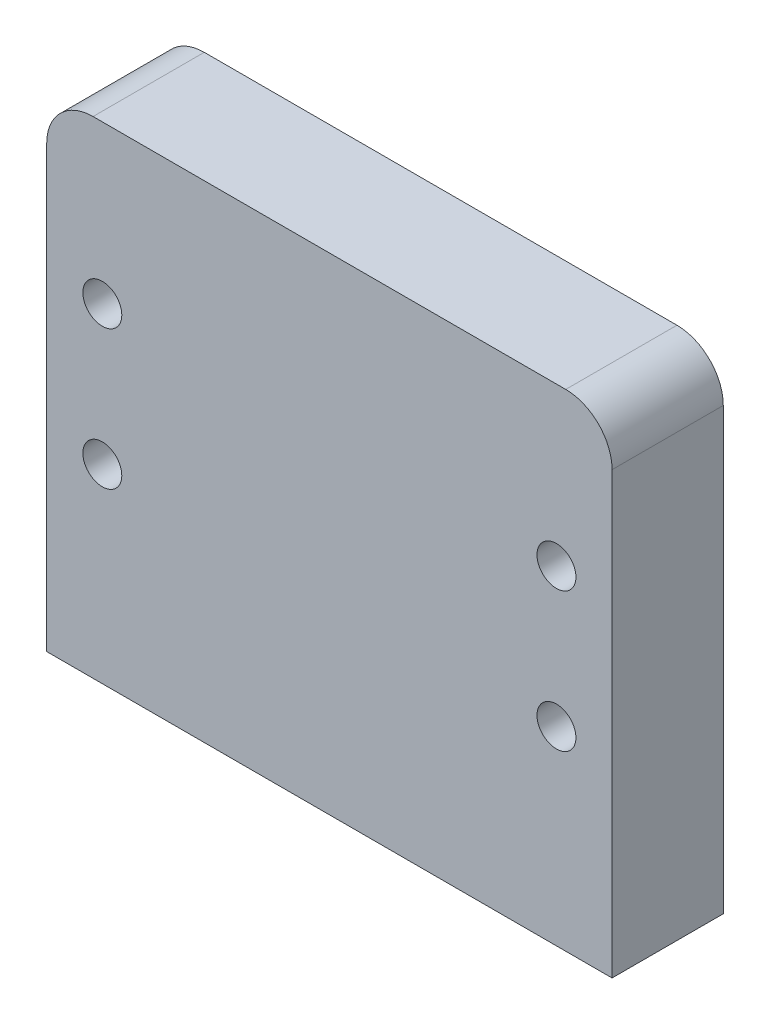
ISO-10303-21;
HEADER;
FILE_DESCRIPTION(('STEP AP214'),'2;1');
FILE_NAME('part.step','',(''),(''),'','','');
FILE_SCHEMA(('AUTOMOTIVE_DESIGN { 1 0 10303 214 1 1 1 1 }'));
ENDSEC;
DATA;
#1=APPLICATION_CONTEXT('core data for automotive mechanical design processes');
#2=APPLICATION_PROTOCOL_DEFINITION('international standard','automotive_design',2000,#1);
#3=PRODUCT_CONTEXT('',#1,'mechanical');
#4=PRODUCT('Part','Part','',(#3));
#5=PRODUCT_RELATED_PRODUCT_CATEGORY('part','',(#4));
#6=PRODUCT_DEFINITION_FORMATION('','',#4);
#7=PRODUCT_DEFINITION_CONTEXT('part definition',#1,'design');
#8=PRODUCT_DEFINITION('design','',#6,#7);
#9=PRODUCT_DEFINITION_SHAPE('','',#8);
#10=(LENGTH_UNIT() NAMED_UNIT(*) SI_UNIT(.MILLI.,.METRE.));
#11=(NAMED_UNIT(*) PLANE_ANGLE_UNIT() SI_UNIT($,.RADIAN.));
#12=(NAMED_UNIT(*) SI_UNIT($,.STERADIAN.) SOLID_ANGLE_UNIT());
#13=UNCERTAINTY_MEASURE_WITH_UNIT(LENGTH_MEASURE(1.E-05),#10,'distance_accuracy_value','');
#14=(GEOMETRIC_REPRESENTATION_CONTEXT(3) GLOBAL_UNCERTAINTY_ASSIGNED_CONTEXT((#13)) GLOBAL_UNIT_ASSIGNED_CONTEXT((#10,
#11,#12)) REPRESENTATION_CONTEXT('',''));
#15=CARTESIAN_POINT('',(0.,0.,0.));
#16=DIRECTION('',(0.,0.,1.));
#17=DIRECTION('',(1.,0.,0.));
#18=AXIS2_PLACEMENT_3D('',#15,#16,#17);
#19=CARTESIAN_POINT('',(-30.5,0.,12.));
#20=DIRECTION('',(1.,0.,0.));
#21=DIRECTION('',(0.,0.,-1.));
#22=AXIS2_PLACEMENT_3D('',#19,#20,#21);
#23=PLANE('',#22);
#24=DIRECTION('',(0.,-1.,0.));
#25=VECTOR('',#24,1.);
#26=CARTESIAN_POINT('',(-30.5,0.,12.));
#27=LINE('',#26,#25);
#28=CARTESIAN_POINT('',(-30.5,47.5,12.));
#29=VERTEX_POINT('',#28);
#30=CARTESIAN_POINT('',(-30.5,0.,12.));
#31=VERTEX_POINT('',#30);
#32=EDGE_CURVE('E90',#29,#31,#27,.T.);
#33=ORIENTED_EDGE('',*,*,#32,.F.);
#34=DIRECTION('',(0.,0.,-1.));
#35=VECTOR('',#34,1.);
#36=CARTESIAN_POINT('',(-30.5,47.5,12.));
#37=LINE('',#36,#35);
#38=CARTESIAN_POINT('',(-30.5,47.5,0.));
#39=VERTEX_POINT('',#38);
#40=EDGE_CURVE('E11',#29,#39,#37,.T.);
#41=ORIENTED_EDGE('',*,*,#40,.T.);
#42=DIRECTION('',(0.,-1.,0.));
#43=VECTOR('',#42,1.);
#44=CARTESIAN_POINT('',(-30.5,0.,0.));
#45=LINE('',#44,#43);
#46=CARTESIAN_POINT('',(-30.5,0.,0.));
#47=VERTEX_POINT('',#46);
#48=EDGE_CURVE('E109',#39,#47,#45,.T.);
#49=ORIENTED_EDGE('',*,*,#48,.T.);
#50=DIRECTION('',(0.,0.,-1.));
#51=VECTOR('',#50,1.);
#52=CARTESIAN_POINT('',(-30.5,0.,12.));
#53=LINE('',#52,#51);
#54=EDGE_CURVE('E103',#31,#47,#53,.T.);
#55=ORIENTED_EDGE('',*,*,#54,.F.);
#56=EDGE_LOOP('',(#33,#41,#49,#55));
#57=FACE_BOUND('',#56,.T.);
#58=ADVANCED_FACE('F35',(#57),#23,.F.);
#59=CARTESIAN_POINT('',(-30.5,0.,12.));
#60=DIRECTION('',(0.,1.,0.));
#61=DIRECTION('',(0.,0.,1.));
#62=AXIS2_PLACEMENT_3D('',#59,#60,#61);
#63=PLANE('',#62);
#64=DIRECTION('',(1.,0.,0.));
#65=VECTOR('',#64,1.);
#66=CARTESIAN_POINT('',(-30.5,0.,0.));
#67=LINE('',#66,#65);
#68=CARTESIAN_POINT('',(30.5,0.,0.));
#69=VERTEX_POINT('',#68);
#70=EDGE_CURVE('E155',#47,#69,#67,.T.);
#71=ORIENTED_EDGE('',*,*,#70,.T.);
#72=DIRECTION('',(0.,0.,-1.));
#73=VECTOR('',#72,1.);
#74=CARTESIAN_POINT('',(30.5,0.,12.));
#75=LINE('',#74,#73);
#76=CARTESIAN_POINT('',(30.5,0.,12.));
#77=VERTEX_POINT('',#76);
#78=EDGE_CURVE('E105',#77,#69,#75,.T.);
#79=ORIENTED_EDGE('',*,*,#78,.F.);
#80=DIRECTION('',(1.,0.,0.));
#81=VECTOR('',#80,1.);
#82=CARTESIAN_POINT('',(-30.5,0.,12.));
#83=LINE('',#82,#81);
#84=EDGE_CURVE('E93',#31,#77,#83,.T.);
#85=ORIENTED_EDGE('',*,*,#84,.F.);
#86=ORIENTED_EDGE('',*,*,#54,.T.);
#87=EDGE_LOOP('',(#71,#79,#85,#86));
#88=FACE_BOUND('',#87,.T.);
#89=ADVANCED_FACE('F102',(#88),#63,.F.);
#90=CARTESIAN_POINT('',(30.5,0.,12.));
#91=DIRECTION('',(-1.,0.,0.));
#92=DIRECTION('',(0.,0.,1.));
#93=AXIS2_PLACEMENT_3D('',#90,#91,#92);
#94=PLANE('',#93);
#95=DIRECTION('',(0.,1.,0.));
#96=VECTOR('',#95,1.);
#97=CARTESIAN_POINT('',(30.5,0.,0.));
#98=LINE('',#97,#96);
#99=CARTESIAN_POINT('',(30.5,47.5,0.));
#100=VERTEX_POINT('',#99);
#101=EDGE_CURVE('E157',#69,#100,#98,.T.);
#102=ORIENTED_EDGE('',*,*,#101,.T.);
#103=DIRECTION('',(0.,0.,-1.));
#104=VECTOR('',#103,1.);
#105=CARTESIAN_POINT('',(30.5,47.5,12.));
#106=LINE('',#105,#104);
#107=CARTESIAN_POINT('',(30.5,47.5,12.));
#108=VERTEX_POINT('',#107);
#109=EDGE_CURVE('E60',#100,#108,#106,.F.);
#110=ORIENTED_EDGE('',*,*,#109,.T.);
#111=DIRECTION('',(0.,1.,0.));
#112=VECTOR('',#111,1.);
#113=CARTESIAN_POINT('',(30.5,0.,12.));
#114=LINE('',#113,#112);
#115=EDGE_CURVE('E106',#77,#108,#114,.T.);
#116=ORIENTED_EDGE('',*,*,#115,.F.);
#117=ORIENTED_EDGE('',*,*,#78,.T.);
#118=EDGE_LOOP('',(#102,#110,#116,#117));
#119=FACE_BOUND('',#118,.T.);
#120=ADVANCED_FACE('F169',(#119),#94,.F.);
#121=CARTESIAN_POINT('',(-30.5,52.5,12.));
#122=DIRECTION('',(0.,-1.,0.));
#123=DIRECTION('',(0.,0.,-1.));
#124=AXIS2_PLACEMENT_3D('',#121,#122,#123);
#125=PLANE('',#124);
#126=DIRECTION('',(-1.,0.,0.));
#127=VECTOR('',#126,1.);
#128=CARTESIAN_POINT('',(-30.5,52.5,12.));
#129=LINE('',#128,#127);
#130=CARTESIAN_POINT('',(25.5,52.5,12.));
#131=VERTEX_POINT('',#130);
#132=CARTESIAN_POINT('',(-25.5,52.5,12.));
#133=VERTEX_POINT('',#132);
#134=EDGE_CURVE('E115',#131,#133,#129,.T.);
#135=ORIENTED_EDGE('',*,*,#134,.F.);
#136=DIRECTION('',(0.,0.,-1.));
#137=VECTOR('',#136,1.);
#138=CARTESIAN_POINT('',(25.5,52.5,12.));
#139=LINE('',#138,#137);
#140=CARTESIAN_POINT('',(25.5,52.5,0.));
#141=VERTEX_POINT('',#140);
#142=EDGE_CURVE('E113',#131,#141,#139,.T.);
#143=ORIENTED_EDGE('',*,*,#142,.T.);
#144=DIRECTION('',(-1.,0.,0.));
#145=VECTOR('',#144,1.);
#146=CARTESIAN_POINT('',(-30.5,52.5,0.));
#147=LINE('',#146,#145);
#148=CARTESIAN_POINT('',(-25.5,52.5,0.));
#149=VERTEX_POINT('',#148);
#150=EDGE_CURVE('E98',#141,#149,#147,.T.);
#151=ORIENTED_EDGE('',*,*,#150,.T.);
#152=DIRECTION('',(0.,0.,-1.));
#153=VECTOR('',#152,1.);
#154=CARTESIAN_POINT('',(-25.5,52.5,12.));
#155=LINE('',#154,#153);
#156=EDGE_CURVE('E111',#149,#133,#155,.F.);
#157=ORIENTED_EDGE('',*,*,#156,.T.);
#158=EDGE_LOOP('',(#135,#143,#151,#157));
#159=FACE_BOUND('',#158,.T.);
#160=ADVANCED_FACE('F163',(#159),#125,.F.);
#161=CARTESIAN_POINT('',(-30.5,52.5,12.));
#162=DIRECTION('',(0.,0.,-1.));
#163=DIRECTION('',(-1.,0.,0.));
#164=AXIS2_PLACEMENT_3D('',#161,#162,#163);
#165=PLANE('',#164);
#166=CARTESIAN_POINT('',(-24.5,35.5,12.));
#167=DIRECTION('',(0.,0.,1.));
#168=DIRECTION('',(1.,0.,0.));
#169=AXIS2_PLACEMENT_3D('',#166,#167,#168);
#170=CIRCLE('',#169,2.1);
#171=CARTESIAN_POINT('',(-22.4,35.5,12.));
#172=VERTEX_POINT('',#171);
#173=EDGE_CURVE('E147',#172,#172,#170,.T.);
#174=ORIENTED_EDGE('',*,*,#173,.F.);
#175=EDGE_LOOP('',(#174));
#176=FACE_BOUND('',#175,.T.);
#177=CARTESIAN_POINT('',(-24.5,20.5,12.));
#178=DIRECTION('',(0.,0.,1.));
#179=DIRECTION('',(1.,0.,0.));
#180=AXIS2_PLACEMENT_3D('',#177,#178,#179);
#181=CIRCLE('',#180,2.1);
#182=CARTESIAN_POINT('',(-22.4,20.5,12.));
#183=VERTEX_POINT('',#182);
#184=EDGE_CURVE('E137',#183,#183,#181,.T.);
#185=ORIENTED_EDGE('',*,*,#184,.F.);
#186=EDGE_LOOP('',(#185));
#187=FACE_BOUND('',#186,.T.);
#188=CARTESIAN_POINT('',(24.5,20.5,12.));
#189=DIRECTION('',(0.,0.,1.));
#190=DIRECTION('',(1.,0.,0.));
#191=AXIS2_PLACEMENT_3D('',#188,#189,#190);
#192=CIRCLE('',#191,2.1);
#193=CARTESIAN_POINT('',(26.6,20.5,12.));
#194=VERTEX_POINT('',#193);
#195=EDGE_CURVE('E134',#194,#194,#192,.T.);
#196=ORIENTED_EDGE('',*,*,#195,.F.);
#197=EDGE_LOOP('',(#196));
#198=FACE_BOUND('',#197,.T.);
#199=CARTESIAN_POINT('',(24.5,35.5,12.));
#200=DIRECTION('',(0.,0.,1.));
#201=DIRECTION('',(1.,0.,0.));
#202=AXIS2_PLACEMENT_3D('',#199,#200,#201);
#203=CIRCLE('',#202,2.1);
#204=CARTESIAN_POINT('',(26.6,35.5,12.));
#205=VERTEX_POINT('',#204);
#206=EDGE_CURVE('E131',#205,#205,#203,.T.);
#207=ORIENTED_EDGE('',*,*,#206,.F.);
#208=EDGE_LOOP('',(#207));
#209=FACE_BOUND('',#208,.T.);
#210=ORIENTED_EDGE('',*,*,#115,.T.);
#211=CARTESIAN_POINT('',(25.5,47.5,12.));
#212=DIRECTION('',(0.,0.,-1.));
#213=DIRECTION('',(-1.,0.,0.));
#214=AXIS2_PLACEMENT_3D('',#211,#212,#213);
#215=CIRCLE('',#214,5.);
#216=EDGE_CURVE('E44',#108,#131,#215,.F.);
#217=ORIENTED_EDGE('',*,*,#216,.T.);
#218=ORIENTED_EDGE('',*,*,#134,.T.);
#219=CARTESIAN_POINT('',(-25.5,47.5,12.));
#220=DIRECTION('',(0.,0.,-1.));
#221=DIRECTION('',(-1.,0.,0.));
#222=AXIS2_PLACEMENT_3D('',#219,#220,#221);
#223=CIRCLE('',#222,5.);
#224=EDGE_CURVE('E52',#133,#29,#223,.F.);
#225=ORIENTED_EDGE('',*,*,#224,.T.);
#226=ORIENTED_EDGE('',*,*,#32,.T.);
#227=ORIENTED_EDGE('',*,*,#84,.T.);
#228=EDGE_LOOP('',(#210,#217,#218,#225,#226,#227));
#229=FACE_BOUND('',#228,.T.);
#230=ADVANCED_FACE('F92',(#176,#187,#198,#209,#229),#165,.F.);
#231=CARTESIAN_POINT('',(-30.5,52.5,0.));
#232=DIRECTION('',(0.,0.,-1.));
#233=DIRECTION('',(-1.,0.,0.));
#234=AXIS2_PLACEMENT_3D('',#231,#232,#233);
#235=PLANE('',#234);
#236=CARTESIAN_POINT('',(-24.5,35.5,0.));
#237=DIRECTION('',(0.,0.,-1.));
#238=DIRECTION('',(-1.,0.,0.));
#239=AXIS2_PLACEMENT_3D('',#236,#237,#238);
#240=CIRCLE('',#239,2.1);
#241=CARTESIAN_POINT('',(-26.6,35.5,0.));
#242=VERTEX_POINT('',#241);
#243=EDGE_CURVE('E39',#242,#242,#240,.T.);
#244=ORIENTED_EDGE('',*,*,#243,.F.);
#245=EDGE_LOOP('',(#244));
#246=FACE_BOUND('',#245,.T.);
#247=CARTESIAN_POINT('',(-24.5,20.5,0.));
#248=DIRECTION('',(0.,0.,-1.));
#249=DIRECTION('',(-1.,0.,0.));
#250=AXIS2_PLACEMENT_3D('',#247,#248,#249);
#251=CIRCLE('',#250,2.1);
#252=CARTESIAN_POINT('',(-26.6,20.5,0.));
#253=VERTEX_POINT('',#252);
#254=EDGE_CURVE('E135',#253,#253,#251,.T.);
#255=ORIENTED_EDGE('',*,*,#254,.F.);
#256=EDGE_LOOP('',(#255));
#257=FACE_BOUND('',#256,.T.);
#258=CARTESIAN_POINT('',(24.5,20.5,0.));
#259=DIRECTION('',(0.,0.,-1.));
#260=DIRECTION('',(-1.,0.,0.));
#261=AXIS2_PLACEMENT_3D('',#258,#259,#260);
#262=CIRCLE('',#261,2.1);
#263=CARTESIAN_POINT('',(22.4,20.5,0.));
#264=VERTEX_POINT('',#263);
#265=EDGE_CURVE('E132',#264,#264,#262,.T.);
#266=ORIENTED_EDGE('',*,*,#265,.F.);
#267=EDGE_LOOP('',(#266));
#268=FACE_BOUND('',#267,.T.);
#269=CARTESIAN_POINT('',(24.5,35.5,0.));
#270=DIRECTION('',(0.,0.,-1.));
#271=DIRECTION('',(-1.,0.,0.));
#272=AXIS2_PLACEMENT_3D('',#269,#270,#271);
#273=CIRCLE('',#272,2.1);
#274=CARTESIAN_POINT('',(22.4,35.5,0.));
#275=VERTEX_POINT('',#274);
#276=EDGE_CURVE('E128',#275,#275,#273,.T.);
#277=ORIENTED_EDGE('',*,*,#276,.F.);
#278=EDGE_LOOP('',(#277));
#279=FACE_BOUND('',#278,.T.);
#280=ORIENTED_EDGE('',*,*,#150,.F.);
#281=CARTESIAN_POINT('',(25.5,47.5,0.));
#282=DIRECTION('',(0.,0.,-1.));
#283=DIRECTION('',(-1.,0.,0.));
#284=AXIS2_PLACEMENT_3D('',#281,#282,#283);
#285=CIRCLE('',#284,5.);
#286=EDGE_CURVE('E123',#141,#100,#285,.T.);
#287=ORIENTED_EDGE('',*,*,#286,.T.);
#288=ORIENTED_EDGE('',*,*,#101,.F.);
#289=ORIENTED_EDGE('',*,*,#70,.F.);
#290=ORIENTED_EDGE('',*,*,#48,.F.);
#291=CARTESIAN_POINT('',(-25.5,47.5,0.));
#292=DIRECTION('',(0.,0.,-1.));
#293=DIRECTION('',(-1.,0.,0.));
#294=AXIS2_PLACEMENT_3D('',#291,#292,#293);
#295=CIRCLE('',#294,5.);
#296=EDGE_CURVE('E121',#39,#149,#295,.T.);
#297=ORIENTED_EDGE('',*,*,#296,.T.);
#298=EDGE_LOOP('',(#280,#287,#288,#289,#290,#297));
#299=FACE_BOUND('',#298,.T.);
#300=ADVANCED_FACE('F167',(#246,#257,#268,#279,#299),#235,.T.);
#301=CARTESIAN_POINT('',(25.5,47.5,12.));
#302=DIRECTION('',(0.,0.,-1.));
#303=DIRECTION('',(-1.,0.,0.));
#304=AXIS2_PLACEMENT_3D('',#301,#302,#303);
#305=CYLINDRICAL_SURFACE('',#304,5.);
#306=ORIENTED_EDGE('',*,*,#216,.F.);
#307=ORIENTED_EDGE('',*,*,#109,.F.);
#308=ORIENTED_EDGE('',*,*,#286,.F.);
#309=ORIENTED_EDGE('',*,*,#142,.F.);
#310=EDGE_LOOP('',(#306,#307,#308,#309));
#311=FACE_BOUND('',#310,.T.);
#312=ADVANCED_FACE('F172',(#311),#305,.T.);
#313=CARTESIAN_POINT('',(-25.5,47.5,12.));
#314=DIRECTION('',(0.,0.,-1.));
#315=DIRECTION('',(-1.,0.,0.));
#316=AXIS2_PLACEMENT_3D('',#313,#314,#315);
#317=CYLINDRICAL_SURFACE('',#316,5.);
#318=ORIENTED_EDGE('',*,*,#224,.F.);
#319=ORIENTED_EDGE('',*,*,#156,.F.);
#320=ORIENTED_EDGE('',*,*,#296,.F.);
#321=ORIENTED_EDGE('',*,*,#40,.F.);
#322=EDGE_LOOP('',(#318,#319,#320,#321));
#323=FACE_BOUND('',#322,.T.);
#324=ADVANCED_FACE('F37',(#323),#317,.T.);
#325=CARTESIAN_POINT('',(24.5,35.5,12.));
#326=DIRECTION('',(0.,0.,1.));
#327=DIRECTION('',(1.,0.,0.));
#328=AXIS2_PLACEMENT_3D('',#325,#326,#327);
#329=CYLINDRICAL_SURFACE('',#328,2.1);
#330=ORIENTED_EDGE('',*,*,#276,.T.);
#331=EDGE_LOOP('',(#330));
#332=FACE_BOUND('',#331,.T.);
#333=ORIENTED_EDGE('',*,*,#206,.T.);
#334=EDGE_LOOP('',(#333));
#335=FACE_BOUND('',#334,.T.);
#336=ADVANCED_FACE('F178',(#332,#335),#329,.F.);
#337=CARTESIAN_POINT('',(24.5,20.5,12.));
#338=DIRECTION('',(0.,0.,1.));
#339=DIRECTION('',(1.,0.,0.));
#340=AXIS2_PLACEMENT_3D('',#337,#338,#339);
#341=CYLINDRICAL_SURFACE('',#340,2.1);
#342=ORIENTED_EDGE('',*,*,#265,.T.);
#343=EDGE_LOOP('',(#342));
#344=FACE_BOUND('',#343,.T.);
#345=ORIENTED_EDGE('',*,*,#195,.T.);
#346=EDGE_LOOP('',(#345));
#347=FACE_BOUND('',#346,.T.);
#348=ADVANCED_FACE('F197',(#344,#347),#341,.F.);
#349=CARTESIAN_POINT('',(-24.5,20.5,12.));
#350=DIRECTION('',(0.,0.,1.));
#351=DIRECTION('',(1.,0.,0.));
#352=AXIS2_PLACEMENT_3D('',#349,#350,#351);
#353=CYLINDRICAL_SURFACE('',#352,2.1);
#354=ORIENTED_EDGE('',*,*,#254,.T.);
#355=EDGE_LOOP('',(#354));
#356=FACE_BOUND('',#355,.T.);
#357=ORIENTED_EDGE('',*,*,#184,.T.);
#358=EDGE_LOOP('',(#357));
#359=FACE_BOUND('',#358,.T.);
#360=ADVANCED_FACE('F201',(#356,#359),#353,.F.);
#361=CARTESIAN_POINT('',(-24.5,35.5,12.));
#362=DIRECTION('',(0.,0.,1.));
#363=DIRECTION('',(1.,0.,0.));
#364=AXIS2_PLACEMENT_3D('',#361,#362,#363);
#365=CYLINDRICAL_SURFACE('',#364,2.1);
#366=ORIENTED_EDGE('',*,*,#243,.T.);
#367=EDGE_LOOP('',(#366));
#368=FACE_BOUND('',#367,.T.);
#369=ORIENTED_EDGE('',*,*,#173,.T.);
#370=EDGE_LOOP('',(#369));
#371=FACE_BOUND('',#370,.T.);
#372=ADVANCED_FACE('F205',(#368,#371),#365,.F.);
#373=CLOSED_SHELL('',(#58,#89,#120,#160,#230,#300,#312,#324,#336,#348,#360,#372));
#374=MANIFOLD_SOLID_BREP('B2',#373);
#375=ADVANCED_BREP_SHAPE_REPRESENTATION('',(#18,#374),#14);
#376=SHAPE_DEFINITION_REPRESENTATION(#9,#375);
ENDSEC;
END-ISO-10303-21;
